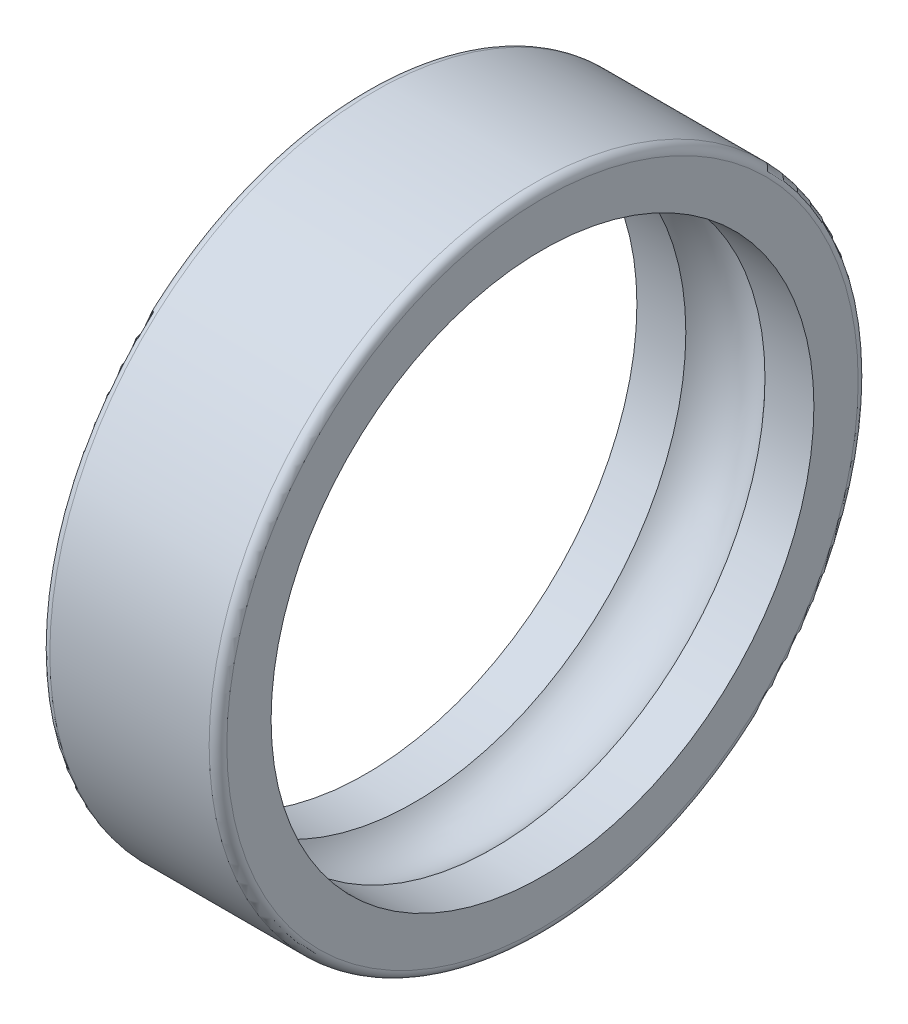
ISO-10303-21;
HEADER;
FILE_DESCRIPTION(('STEP AP214'),'2;1');
FILE_NAME('part.step','',(''),(''),'','','');
FILE_SCHEMA(('AUTOMOTIVE_DESIGN { 1 0 10303 214 1 1 1 1 }'));
ENDSEC;
DATA;
#1=APPLICATION_CONTEXT('core data for automotive mechanical design processes');
#2=APPLICATION_PROTOCOL_DEFINITION('international standard','automotive_design',2000,#1);
#3=PRODUCT_CONTEXT('',#1,'mechanical');
#4=PRODUCT('Part','Part','',(#3));
#5=PRODUCT_RELATED_PRODUCT_CATEGORY('part','',(#4));
#6=PRODUCT_DEFINITION_FORMATION('','',#4);
#7=PRODUCT_DEFINITION_CONTEXT('part definition',#1,'design');
#8=PRODUCT_DEFINITION('design','',#6,#7);
#9=PRODUCT_DEFINITION_SHAPE('','',#8);
#10=(LENGTH_UNIT() NAMED_UNIT(*) SI_UNIT(.MILLI.,.METRE.));
#11=(NAMED_UNIT(*) PLANE_ANGLE_UNIT() SI_UNIT($,.RADIAN.));
#12=(NAMED_UNIT(*) SI_UNIT($,.STERADIAN.) SOLID_ANGLE_UNIT());
#13=UNCERTAINTY_MEASURE_WITH_UNIT(LENGTH_MEASURE(1.E-05),#10,'distance_accuracy_value','');
#14=(GEOMETRIC_REPRESENTATION_CONTEXT(3) GLOBAL_UNCERTAINTY_ASSIGNED_CONTEXT((#13)) GLOBAL_UNIT_ASSIGNED_CONTEXT((#10,
#11,#12)) REPRESENTATION_CONTEXT('',''));
#15=CARTESIAN_POINT('',(0.,0.,0.));
#16=DIRECTION('',(0.,0.,1.));
#17=DIRECTION('',(1.,0.,0.));
#18=AXIS2_PLACEMENT_3D('',#15,#16,#17);
#19=CARTESIAN_POINT('',(0.150000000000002,0.,0.));
#20=DIRECTION('',(-1.,0.,0.));
#21=DIRECTION('',(0.,0.,1.));
#22=AXIS2_PLACEMENT_3D('',#19,#20,#21);
#23=TOROIDAL_SURFACE('',#22,5.35,0.149999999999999);
#24=CARTESIAN_POINT('',(0.,0.,0.));
#25=DIRECTION('',(-1.,0.,0.));
#26=DIRECTION('',(0.,0.,1.));
#27=AXIS2_PLACEMENT_3D('',#24,#25,#26);
#28=CIRCLE('',#27,5.35);
#29=CARTESIAN_POINT('',(0.,0.,5.35));
#30=VERTEX_POINT('',#29);
#31=EDGE_CURVE('E10',#30,#30,#28,.T.);
#32=ORIENTED_EDGE('',*,*,#31,.F.);
#33=EDGE_LOOP('',(#32));
#34=FACE_BOUND('',#33,.T.);
#35=CARTESIAN_POINT('',(0.150000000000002,0.,0.));
#36=DIRECTION('',(-1.,0.,0.));
#37=DIRECTION('',(0.,0.,1.));
#38=AXIS2_PLACEMENT_3D('',#35,#36,#37);
#39=CIRCLE('',#38,5.5);
#40=CARTESIAN_POINT('',(0.150000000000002,0.,5.5));
#41=VERTEX_POINT('',#40);
#42=EDGE_CURVE('E388',#41,#41,#39,.T.);
#43=ORIENTED_EDGE('',*,*,#42,.T.);
#44=EDGE_LOOP('',(#43));
#45=FACE_BOUND('',#44,.T.);
#46=ADVANCED_FACE('F360',(#34,#45),#23,.T.);
#47=CARTESIAN_POINT('',(0.,0.,-5.35));
#48=DIRECTION('',(1.,0.,0.));
#49=DIRECTION('',(0.,0.,-1.));
#50=AXIS2_PLACEMENT_3D('',#47,#48,#49);
#51=PLANE('',#50);
#52=CARTESIAN_POINT('',(0.,0.,0.));
#53=DIRECTION('',(-1.,0.,0.));
#54=DIRECTION('',(0.,0.,1.));
#55=AXIS2_PLACEMENT_3D('',#52,#53,#54);
#56=CIRCLE('',#55,4.6);
#57=CARTESIAN_POINT('',(0.,0.,4.6));
#58=VERTEX_POINT('',#57);
#59=EDGE_CURVE('E366',#58,#58,#56,.T.);
#60=ORIENTED_EDGE('',*,*,#59,.F.);
#61=EDGE_LOOP('',(#60));
#62=FACE_BOUND('',#61,.T.);
#63=ORIENTED_EDGE('',*,*,#31,.T.);
#64=EDGE_LOOP('',(#63));
#65=FACE_BOUND('',#64,.T.);
#66=ADVANCED_FACE('F425',(#62,#65),#51,.F.);
#67=CARTESIAN_POINT('',(0.,0.,0.));
#68=DIRECTION('',(-1.,0.,0.));
#69=DIRECTION('',(0.,0.,1.));
#70=AXIS2_PLACEMENT_3D('',#67,#68,#69);
#71=CYLINDRICAL_SURFACE('',#70,4.6);
#72=CARTESIAN_POINT('',(0.829179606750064,0.,0.));
#73=DIRECTION('',(-1.,0.,0.));
#74=DIRECTION('',(0.,0.,1.));
#75=AXIS2_PLACEMENT_3D('',#72,#73,#74);
#76=CIRCLE('',#75,4.6);
#77=CARTESIAN_POINT('',(0.829179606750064,0.,4.6));
#78=VERTEX_POINT('',#77);
#79=EDGE_CURVE('E370',#78,#78,#76,.T.);
#80=ORIENTED_EDGE('',*,*,#79,.F.);
#81=EDGE_LOOP('',(#80));
#82=FACE_BOUND('',#81,.T.);
#83=ORIENTED_EDGE('',*,*,#59,.T.);
#84=EDGE_LOOP('',(#83));
#85=FACE_BOUND('',#84,.T.);
#86=ADVANCED_FACE('F420',(#82,#85),#71,.F.);
#87=CARTESIAN_POINT('',(1.5,0.,0.));
#88=DIRECTION('',(-1.,0.,0.));
#89=DIRECTION('',(0.,0.,1.));
#90=AXIS2_PLACEMENT_3D('',#87,#88,#89);
#91=TOROIDAL_SURFACE('',#90,4.,0.9);
#92=CARTESIAN_POINT('',(2.17082039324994,0.,0.));
#93=DIRECTION('',(-1.,0.,0.));
#94=DIRECTION('',(0.,0.,1.));
#95=AXIS2_PLACEMENT_3D('',#92,#93,#94);
#96=CIRCLE('',#95,4.6);
#97=CARTESIAN_POINT('',(2.17082039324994,0.,4.6));
#98=VERTEX_POINT('',#97);
#99=EDGE_CURVE('E374',#98,#98,#96,.T.);
#100=ORIENTED_EDGE('',*,*,#99,.F.);
#101=EDGE_LOOP('',(#100));
#102=FACE_BOUND('',#101,.T.);
#103=ORIENTED_EDGE('',*,*,#79,.T.);
#104=EDGE_LOOP('',(#103));
#105=FACE_BOUND('',#104,.T.);
#106=ADVANCED_FACE('F414',(#102,#105),#91,.F.);
#107=CARTESIAN_POINT('',(0.,0.,0.));
#108=DIRECTION('',(-1.,0.,0.));
#109=DIRECTION('',(0.,0.,1.));
#110=AXIS2_PLACEMENT_3D('',#107,#108,#109);
#111=CYLINDRICAL_SURFACE('',#110,4.6);
#112=CARTESIAN_POINT('',(3.,0.,0.));
#113=DIRECTION('',(-1.,0.,0.));
#114=DIRECTION('',(0.,0.,1.));
#115=AXIS2_PLACEMENT_3D('',#112,#113,#114);
#116=CIRCLE('',#115,4.6);
#117=CARTESIAN_POINT('',(3.,0.,4.6));
#118=VERTEX_POINT('',#117);
#119=EDGE_CURVE('E379',#118,#118,#116,.T.);
#120=ORIENTED_EDGE('',*,*,#119,.F.);
#121=EDGE_LOOP('',(#120));
#122=FACE_BOUND('',#121,.T.);
#123=ORIENTED_EDGE('',*,*,#99,.T.);
#124=EDGE_LOOP('',(#123));
#125=FACE_BOUND('',#124,.T.);
#126=ADVANCED_FACE('F408',(#122,#125),#111,.F.);
#127=CARTESIAN_POINT('',(3.,0.,-5.35));
#128=DIRECTION('',(-1.,0.,0.));
#129=DIRECTION('',(0.,0.,1.));
#130=AXIS2_PLACEMENT_3D('',#127,#128,#129);
#131=PLANE('',#130);
#132=CARTESIAN_POINT('',(3.,0.,0.));
#133=DIRECTION('',(-1.,0.,0.));
#134=DIRECTION('',(0.,0.,1.));
#135=AXIS2_PLACEMENT_3D('',#132,#133,#134);
#136=CIRCLE('',#135,5.35);
#137=CARTESIAN_POINT('',(3.,0.,5.35));
#138=VERTEX_POINT('',#137);
#139=EDGE_CURVE('E382',#138,#138,#136,.T.);
#140=ORIENTED_EDGE('',*,*,#139,.F.);
#141=EDGE_LOOP('',(#140));
#142=FACE_BOUND('',#141,.T.);
#143=ORIENTED_EDGE('',*,*,#119,.T.);
#144=EDGE_LOOP('',(#143));
#145=FACE_BOUND('',#144,.T.);
#146=ADVANCED_FACE('F402',(#142,#145),#131,.F.);
#147=CARTESIAN_POINT('',(2.85,0.,0.));
#148=DIRECTION('',(-1.,0.,0.));
#149=DIRECTION('',(0.,0.,1.));
#150=AXIS2_PLACEMENT_3D('',#147,#148,#149);
#151=TOROIDAL_SURFACE('',#150,5.35,0.149999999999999);
#152=CARTESIAN_POINT('',(2.85,0.,0.));
#153=DIRECTION('',(-1.,0.,0.));
#154=DIRECTION('',(0.,0.,1.));
#155=AXIS2_PLACEMENT_3D('',#152,#153,#154);
#156=CIRCLE('',#155,5.5);
#157=CARTESIAN_POINT('',(2.85,0.,5.5));
#158=VERTEX_POINT('',#157);
#159=EDGE_CURVE('E385',#158,#158,#156,.T.);
#160=ORIENTED_EDGE('',*,*,#159,.F.);
#161=EDGE_LOOP('',(#160));
#162=FACE_BOUND('',#161,.T.);
#163=ORIENTED_EDGE('',*,*,#139,.T.);
#164=EDGE_LOOP('',(#163));
#165=FACE_BOUND('',#164,.T.);
#166=ADVANCED_FACE('F396',(#162,#165),#151,.T.);
#167=CARTESIAN_POINT('',(0.,0.,0.));
#168=DIRECTION('',(-1.,0.,0.));
#169=DIRECTION('',(0.,0.,1.));
#170=AXIS2_PLACEMENT_3D('',#167,#168,#169);
#171=CYLINDRICAL_SURFACE('',#170,5.5);
#172=ORIENTED_EDGE('',*,*,#42,.F.);
#173=EDGE_LOOP('',(#172));
#174=FACE_BOUND('',#173,.T.);
#175=ORIENTED_EDGE('',*,*,#159,.T.);
#176=EDGE_LOOP('',(#175));
#177=FACE_BOUND('',#176,.T.);
#178=ADVANCED_FACE('F393',(#174,#177),#171,.T.);
#179=CLOSED_SHELL('',(#46,#66,#86,#106,#126,#146,#166,#178));
#180=MANIFOLD_SOLID_BREP('B2',#179);
#181=ADVANCED_BREP_SHAPE_REPRESENTATION('',(#18,#180),#14);
#182=SHAPE_DEFINITION_REPRESENTATION(#9,#181);
ENDSEC;
END-ISO-10303-21;
